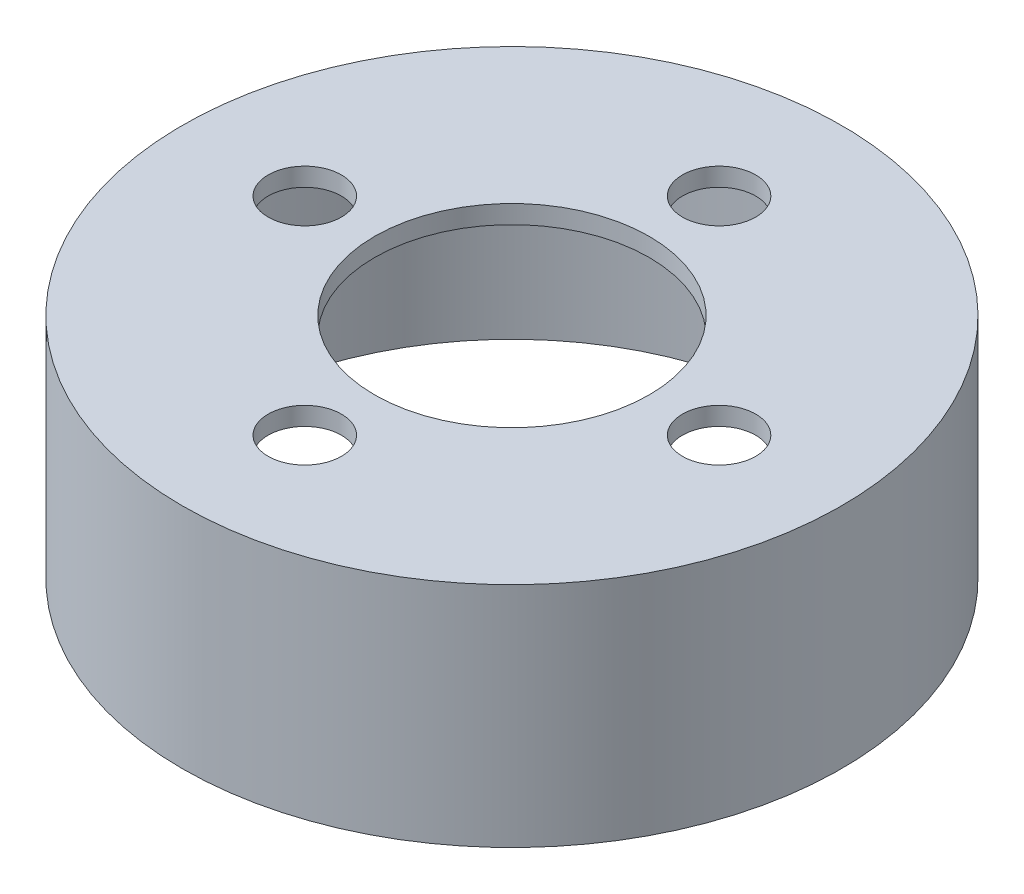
ISO-10303-21;
HEADER;
FILE_DESCRIPTION(('STEP AP214'),'2;1');
FILE_NAME('part.step','',(''),(''),'','','');
FILE_SCHEMA(('AUTOMOTIVE_DESIGN { 1 0 10303 214 1 1 1 1 }'));
ENDSEC;
DATA;
#1=APPLICATION_CONTEXT('core data for automotive mechanical design processes');
#2=APPLICATION_PROTOCOL_DEFINITION('international standard','automotive_design',2000,#1);
#3=PRODUCT_CONTEXT('',#1,'mechanical');
#4=PRODUCT('Part','Part','',(#3));
#5=PRODUCT_RELATED_PRODUCT_CATEGORY('part','',(#4));
#6=PRODUCT_DEFINITION_FORMATION('','',#4);
#7=PRODUCT_DEFINITION_CONTEXT('part definition',#1,'design');
#8=PRODUCT_DEFINITION('design','',#6,#7);
#9=PRODUCT_DEFINITION_SHAPE('','',#8);
#10=(LENGTH_UNIT() NAMED_UNIT(*) SI_UNIT(.MILLI.,.METRE.));
#11=(NAMED_UNIT(*) PLANE_ANGLE_UNIT() SI_UNIT($,.RADIAN.));
#12=(NAMED_UNIT(*) SI_UNIT($,.STERADIAN.) SOLID_ANGLE_UNIT());
#13=UNCERTAINTY_MEASURE_WITH_UNIT(LENGTH_MEASURE(1.E-05),#10,'distance_accuracy_value','');
#14=(GEOMETRIC_REPRESENTATION_CONTEXT(3) GLOBAL_UNCERTAINTY_ASSIGNED_CONTEXT((#13)) GLOBAL_UNIT_ASSIGNED_CONTEXT((#10,
#11,#12)) REPRESENTATION_CONTEXT('',''));
#15=CARTESIAN_POINT('',(0.,0.,0.));
#16=DIRECTION('',(0.,0.,1.));
#17=DIRECTION('',(1.,0.,0.));
#18=AXIS2_PLACEMENT_3D('',#15,#16,#17);
#19=CARTESIAN_POINT('',(0.,-12.433679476,0.));
#20=DIRECTION('',(0.,1.,0.));
#21=DIRECTION('',(0.,0.,1.));
#22=AXIS2_PLACEMENT_3D('',#19,#20,#21);
#23=CYLINDRICAL_SURFACE('',#22,16.);
#24=CARTESIAN_POINT('',(0.,-12.433679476,0.));
#25=DIRECTION('',(0.,1.,0.));
#26=DIRECTION('',(0.,0.,1.));
#27=AXIS2_PLACEMENT_3D('',#24,#25,#26);
#28=CIRCLE('',#27,16.);
#29=CARTESIAN_POINT('',(0.,-12.433679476,16.));
#30=VERTEX_POINT('',#29);
#31=EDGE_CURVE('E50',#30,#30,#28,.T.);
#32=ORIENTED_EDGE('',*,*,#31,.F.);
#33=EDGE_LOOP('',(#32));
#34=FACE_BOUND('',#33,.T.);
#35=CARTESIAN_POINT('',(0.,-1.,0.));
#36=DIRECTION('',(0.,1.,0.));
#37=DIRECTION('',(0.,0.,1.));
#38=AXIS2_PLACEMENT_3D('',#35,#36,#37);
#39=CIRCLE('',#38,16.);
#40=CARTESIAN_POINT('',(0.,-1.,16.));
#41=VERTEX_POINT('',#40);
#42=EDGE_CURVE('E10',#41,#41,#39,.F.);
#43=ORIENTED_EDGE('',*,*,#42,.F.);
#44=EDGE_LOOP('',(#43));
#45=FACE_BOUND('',#44,.T.);
#46=ADVANCED_FACE('F34',(#34,#45),#23,.F.);
#47=CARTESIAN_POINT('',(0.,-12.433679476,0.));
#48=DIRECTION('',(0.,1.,0.));
#49=DIRECTION('',(0.,0.,1.));
#50=AXIS2_PLACEMENT_3D('',#47,#48,#49);
#51=CYLINDRICAL_SURFACE('',#50,18.);
#52=CARTESIAN_POINT('',(0.,-12.433679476,0.));
#53=DIRECTION('',(0.,1.,0.));
#54=DIRECTION('',(0.,0.,1.));
#55=AXIS2_PLACEMENT_3D('',#52,#53,#54);
#56=CIRCLE('',#55,18.);
#57=CARTESIAN_POINT('',(0.,-12.433679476,18.));
#58=VERTEX_POINT('',#57);
#59=EDGE_CURVE('E41',#58,#58,#56,.T.);
#60=ORIENTED_EDGE('',*,*,#59,.T.);
#61=EDGE_LOOP('',(#60));
#62=FACE_BOUND('',#61,.T.);
#63=CARTESIAN_POINT('',(0.,0.,0.));
#64=DIRECTION('',(0.,1.,0.));
#65=DIRECTION('',(0.,0.,1.));
#66=AXIS2_PLACEMENT_3D('',#63,#64,#65);
#67=CIRCLE('',#66,18.);
#68=CARTESIAN_POINT('',(0.,0.,18.));
#69=VERTEX_POINT('',#68);
#70=EDGE_CURVE('E45',#69,#69,#67,.T.);
#71=ORIENTED_EDGE('',*,*,#70,.F.);
#72=EDGE_LOOP('',(#71));
#73=FACE_BOUND('',#72,.T.);
#74=ADVANCED_FACE('F36',(#62,#73),#51,.T.);
#75=CARTESIAN_POINT('',(0.,-12.433679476,0.));
#76=DIRECTION('',(0.,1.,0.));
#77=DIRECTION('',(0.,0.,1.));
#78=AXIS2_PLACEMENT_3D('',#75,#76,#77);
#79=PLANE('',#78);
#80=ORIENTED_EDGE('',*,*,#31,.T.);
#81=EDGE_LOOP('',(#80));
#82=FACE_BOUND('',#81,.T.);
#83=ORIENTED_EDGE('',*,*,#59,.F.);
#84=EDGE_LOOP('',(#83));
#85=FACE_BOUND('',#84,.T.);
#86=ADVANCED_FACE('F92',(#82,#85),#79,.F.);
#87=CARTESIAN_POINT('',(0.,0.,0.));
#88=DIRECTION('',(0.,1.,0.));
#89=DIRECTION('',(0.,0.,1.));
#90=AXIS2_PLACEMENT_3D('',#87,#88,#89);
#91=PLANE('',#90);
#92=CARTESIAN_POINT('',(11.3137085,0.,0.));
#93=DIRECTION('',(0.,1.,0.));
#94=DIRECTION('',(1.,0.,0.));
#95=AXIS2_PLACEMENT_3D('',#92,#93,#94);
#96=CIRCLE('',#95,2.);
#97=CARTESIAN_POINT('',(11.3137085,0.,1.99999999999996));
#98=VERTEX_POINT('',#97);
#99=EDGE_CURVE('E77',#98,#98,#96,.T.);
#100=ORIENTED_EDGE('',*,*,#99,.F.);
#101=EDGE_LOOP('',(#100));
#102=FACE_BOUND('',#101,.T.);
#103=CARTESIAN_POINT('',(0.,0.,-11.3137085));
#104=DIRECTION('',(0.,1.,0.));
#105=DIRECTION('',(0.,0.,-1.));
#106=AXIS2_PLACEMENT_3D('',#103,#104,#105);
#107=CIRCLE('',#106,2.);
#108=CARTESIAN_POINT('',(0.,0.,-9.3137085));
#109=VERTEX_POINT('',#108);
#110=EDGE_CURVE('E70',#109,#109,#107,.T.);
#111=ORIENTED_EDGE('',*,*,#110,.F.);
#112=EDGE_LOOP('',(#111));
#113=FACE_BOUND('',#112,.T.);
#114=CARTESIAN_POINT('',(-11.3137085,0.,1.18504806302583E-13));
#115=DIRECTION('',(0.,1.,0.));
#116=DIRECTION('',(-1.,0.,0.));
#117=AXIS2_PLACEMENT_3D('',#114,#115,#116);
#118=CIRCLE('',#117,2.);
#119=CARTESIAN_POINT('',(-11.3137085,0.,2.00000000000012));
#120=VERTEX_POINT('',#119);
#121=EDGE_CURVE('E71',#120,#120,#118,.T.);
#122=ORIENTED_EDGE('',*,*,#121,.F.);
#123=EDGE_LOOP('',(#122));
#124=FACE_BOUND('',#123,.T.);
#125=CARTESIAN_POINT('',(0.,0.,11.3137085));
#126=DIRECTION('',(0.,1.,0.));
#127=DIRECTION('',(0.,0.,1.));
#128=AXIS2_PLACEMENT_3D('',#125,#126,#127);
#129=CIRCLE('',#128,2.);
#130=CARTESIAN_POINT('',(0.,0.,13.3137085));
#131=VERTEX_POINT('',#130);
#132=EDGE_CURVE('E63',#131,#131,#129,.T.);
#133=ORIENTED_EDGE('',*,*,#132,.F.);
#134=EDGE_LOOP('',(#133));
#135=FACE_BOUND('',#134,.T.);
#136=ORIENTED_EDGE('',*,*,#70,.T.);
#137=EDGE_LOOP('',(#136));
#138=FACE_BOUND('',#137,.T.);
#139=CARTESIAN_POINT('',(0.,0.,0.));
#140=DIRECTION('',(0.,1.,0.));
#141=DIRECTION('',(0.,0.,1.));
#142=AXIS2_PLACEMENT_3D('',#139,#140,#141);
#143=CIRCLE('',#142,7.50000000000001);
#144=CARTESIAN_POINT('',(0.,0.,7.50000000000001));
#145=VERTEX_POINT('',#144);
#146=EDGE_CURVE('E55',#145,#145,#143,.T.);
#147=ORIENTED_EDGE('',*,*,#146,.F.);
#148=EDGE_LOOP('',(#147));
#149=FACE_BOUND('',#148,.T.);
#150=ADVANCED_FACE('F88',(#102,#113,#124,#135,#138,#149),#91,.T.);
#151=CARTESIAN_POINT('',(0.,-1.,0.));
#152=DIRECTION('',(0.,1.,0.));
#153=DIRECTION('',(0.,0.,1.));
#154=AXIS2_PLACEMENT_3D('',#151,#152,#153);
#155=PLANE('',#154);
#156=CARTESIAN_POINT('',(11.3137085,-0.999999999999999,0.));
#157=DIRECTION('',(0.,1.,0.));
#158=DIRECTION('',(0.,0.,1.));
#159=AXIS2_PLACEMENT_3D('',#156,#157,#158);
#160=CIRCLE('',#159,2.);
#161=CARTESIAN_POINT('',(11.3137085,-1.,1.99999999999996));
#162=VERTEX_POINT('',#161);
#163=EDGE_CURVE('E66',#162,#162,#160,.F.);
#164=ORIENTED_EDGE('',*,*,#163,.F.);
#165=EDGE_LOOP('',(#164));
#166=FACE_BOUND('',#165,.T.);
#167=CARTESIAN_POINT('',(0.,-0.999999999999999,-11.3137085));
#168=DIRECTION('',(0.,1.,0.));
#169=DIRECTION('',(0.,0.,1.));
#170=AXIS2_PLACEMENT_3D('',#167,#168,#169);
#171=CIRCLE('',#170,2.);
#172=CARTESIAN_POINT('',(0.,-1.,-9.3137085));
#173=VERTEX_POINT('',#172);
#174=EDGE_CURVE('E74',#173,#173,#171,.F.);
#175=ORIENTED_EDGE('',*,*,#174,.F.);
#176=EDGE_LOOP('',(#175));
#177=FACE_BOUND('',#176,.T.);
#178=CARTESIAN_POINT('',(-11.3137085,-0.999999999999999,1.18504806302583E-13));
#179=DIRECTION('',(0.,1.,0.));
#180=DIRECTION('',(0.,0.,1.));
#181=AXIS2_PLACEMENT_3D('',#178,#179,#180);
#182=CIRCLE('',#181,2.);
#183=CARTESIAN_POINT('',(-11.3137085,-1.,2.00000000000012));
#184=VERTEX_POINT('',#183);
#185=EDGE_CURVE('E67',#184,#184,#182,.F.);
#186=ORIENTED_EDGE('',*,*,#185,.F.);
#187=EDGE_LOOP('',(#186));
#188=FACE_BOUND('',#187,.T.);
#189=CARTESIAN_POINT('',(0.,-0.999999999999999,11.3137085));
#190=DIRECTION('',(0.,1.,0.));
#191=DIRECTION('',(0.,0.,1.));
#192=AXIS2_PLACEMENT_3D('',#189,#190,#191);
#193=CIRCLE('',#192,2.);
#194=CARTESIAN_POINT('',(0.,-1.,13.3137085));
#195=VERTEX_POINT('',#194);
#196=EDGE_CURVE('E58',#195,#195,#193,.F.);
#197=ORIENTED_EDGE('',*,*,#196,.F.);
#198=EDGE_LOOP('',(#197));
#199=FACE_BOUND('',#198,.T.);
#200=CARTESIAN_POINT('',(0.,-1.,0.));
#201=DIRECTION('',(0.,1.,0.));
#202=DIRECTION('',(0.,0.,1.));
#203=AXIS2_PLACEMENT_3D('',#200,#201,#202);
#204=CIRCLE('',#203,7.50000000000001);
#205=CARTESIAN_POINT('',(0.,-1.,7.50000000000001));
#206=VERTEX_POINT('',#205);
#207=EDGE_CURVE('E54',#206,#206,#204,.T.);
#208=ORIENTED_EDGE('',*,*,#207,.T.);
#209=EDGE_LOOP('',(#208));
#210=FACE_BOUND('',#209,.T.);
#211=ORIENTED_EDGE('',*,*,#42,.T.);
#212=EDGE_LOOP('',(#211));
#213=FACE_BOUND('',#212,.T.);
#214=ADVANCED_FACE('F91',(#166,#177,#188,#199,#210,#213),#155,.F.);
#215=CARTESIAN_POINT('',(0.,-1.,0.));
#216=DIRECTION('',(0.,1.,0.));
#217=DIRECTION('',(0.,0.,1.));
#218=AXIS2_PLACEMENT_3D('',#215,#216,#217);
#219=CYLINDRICAL_SURFACE('',#218,7.50000000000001);
#220=ORIENTED_EDGE('',*,*,#207,.F.);
#221=EDGE_LOOP('',(#220));
#222=FACE_BOUND('',#221,.T.);
#223=ORIENTED_EDGE('',*,*,#146,.T.);
#224=EDGE_LOOP('',(#223));
#225=FACE_BOUND('',#224,.T.);
#226=ADVANCED_FACE('F103',(#222,#225),#219,.F.);
#227=CARTESIAN_POINT('',(0.,-12.434679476,11.3137085));
#228=DIRECTION('',(0.,1.,0.));
#229=DIRECTION('',(0.,0.,1.));
#230=AXIS2_PLACEMENT_3D('',#227,#228,#229);
#231=CYLINDRICAL_SURFACE('',#230,2.);
#232=CARTESIAN_POINT('',(0.,0.,13.3137085));
#233=CARTESIAN_POINT('',(0.,-0.0104166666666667,13.3137085));
#234=CARTESIAN_POINT('',(0.,-0.0208333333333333,13.3137085));
#235=CARTESIAN_POINT('',(0.,-0.0416666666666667,13.3137085));
#236=CARTESIAN_POINT('',(0.,-0.0520833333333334,13.3137085));
#237=CARTESIAN_POINT('',(0.,-0.0729166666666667,13.3137085));
#238=CARTESIAN_POINT('',(0.,-0.0833333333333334,13.3137085));
#239=CARTESIAN_POINT('',(0.,-0.104166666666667,13.3137085));
#240=CARTESIAN_POINT('',(0.,-0.114583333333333,13.3137085));
#241=CARTESIAN_POINT('',(0.,-0.135416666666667,13.3137085));
#242=CARTESIAN_POINT('',(0.,-0.145833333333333,13.3137085));
#243=CARTESIAN_POINT('',(0.,-0.166666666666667,13.3137085));
#244=CARTESIAN_POINT('',(0.,-0.177083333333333,13.3137085));
#245=CARTESIAN_POINT('',(0.,-0.197916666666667,13.3137085));
#246=CARTESIAN_POINT('',(0.,-0.208333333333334,13.3137085));
#247=CARTESIAN_POINT('',(0.,-0.229166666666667,13.3137085));
#248=CARTESIAN_POINT('',(0.,-0.239583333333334,13.3137085));
#249=CARTESIAN_POINT('',(0.,-0.260416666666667,13.3137085));
#250=CARTESIAN_POINT('',(0.,-0.270833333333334,13.3137085));
#251=CARTESIAN_POINT('',(0.,-0.291666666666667,13.3137085));
#252=CARTESIAN_POINT('',(0.,-0.302083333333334,13.3137085));
#253=CARTESIAN_POINT('',(0.,-0.322916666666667,13.3137085));
#254=CARTESIAN_POINT('',(0.,-0.333333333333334,13.3137085));
#255=CARTESIAN_POINT('',(0.,-0.354166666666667,13.3137085));
#256=CARTESIAN_POINT('',(0.,-0.364583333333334,13.3137085));
#257=CARTESIAN_POINT('',(0.,-0.385416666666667,13.3137085));
#258=CARTESIAN_POINT('',(0.,-0.395833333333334,13.3137085));
#259=CARTESIAN_POINT('',(0.,-0.416666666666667,13.3137085));
#260=CARTESIAN_POINT('',(0.,-0.427083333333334,13.3137085));
#261=CARTESIAN_POINT('',(0.,-0.447916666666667,13.3137085));
#262=CARTESIAN_POINT('',(0.,-0.458333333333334,13.3137085));
#263=CARTESIAN_POINT('',(0.,-0.479166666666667,13.3137085));
#264=CARTESIAN_POINT('',(0.,-0.489583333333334,13.3137085));
#265=CARTESIAN_POINT('',(0.,-0.510416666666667,13.3137085));
#266=CARTESIAN_POINT('',(0.,-0.520833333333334,13.3137085));
#267=CARTESIAN_POINT('',(0.,-0.541666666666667,13.3137085));
#268=CARTESIAN_POINT('',(0.,-0.552083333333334,13.3137085));
#269=CARTESIAN_POINT('',(0.,-0.572916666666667,13.3137085));
#270=CARTESIAN_POINT('',(0.,-0.583333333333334,13.3137085));
#271=CARTESIAN_POINT('',(0.,-0.604166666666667,13.3137085));
#272=CARTESIAN_POINT('',(0.,-0.614583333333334,13.3137085));
#273=CARTESIAN_POINT('',(0.,-0.635416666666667,13.3137085));
#274=CARTESIAN_POINT('',(0.,-0.645833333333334,13.3137085));
#275=CARTESIAN_POINT('',(0.,-0.666666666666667,13.3137085));
#276=CARTESIAN_POINT('',(0.,-0.677083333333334,13.3137085));
#277=CARTESIAN_POINT('',(0.,-0.697916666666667,13.3137085));
#278=CARTESIAN_POINT('',(0.,-0.708333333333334,13.3137085));
#279=CARTESIAN_POINT('',(0.,-0.729166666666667,13.3137085));
#280=CARTESIAN_POINT('',(0.,-0.739583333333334,13.3137085));
#281=CARTESIAN_POINT('',(0.,-0.760416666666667,13.3137085));
#282=CARTESIAN_POINT('',(0.,-0.770833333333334,13.3137085));
#283=CARTESIAN_POINT('',(0.,-0.791666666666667,13.3137085));
#284=CARTESIAN_POINT('',(0.,-0.802083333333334,13.3137085));
#285=CARTESIAN_POINT('',(0.,-0.822916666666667,13.3137085));
#286=CARTESIAN_POINT('',(0.,-0.833333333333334,13.3137085));
#287=CARTESIAN_POINT('',(0.,-0.854166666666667,13.3137085));
#288=CARTESIAN_POINT('',(0.,-0.864583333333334,13.3137085));
#289=CARTESIAN_POINT('',(0.,-0.885416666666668,13.3137085));
#290=CARTESIAN_POINT('',(0.,-0.895833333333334,13.3137085));
#291=CARTESIAN_POINT('',(0.,-0.916666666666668,13.3137085));
#292=CARTESIAN_POINT('',(0.,-0.927083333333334,13.3137085));
#293=CARTESIAN_POINT('',(0.,-0.947916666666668,13.3137085));
#294=CARTESIAN_POINT('',(0.,-0.958333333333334,13.3137085));
#295=CARTESIAN_POINT('',(0.,-0.979166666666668,13.3137085));
#296=CARTESIAN_POINT('',(0.,-0.989583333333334,13.3137085));
#297=CARTESIAN_POINT('',(0.,-1.,13.3137085));
#298=B_SPLINE_CURVE_WITH_KNOTS('',3,(#232,#233,#234,#235,#236,#237,#238,#239,#240,#241,#242,
#243,#244,#245,#246,#247,#248,#249,#250,#251,#252,#253,#254,#255,#256,#257,#258,#259,#260,#261,
#262,#263,#264,#265,#266,#267,#268,#269,#270,#271,#272,#273,#274,#275,#276,#277,#278,#279,#280,
#281,#282,#283,#284,#285,#286,#287,#288,#289,#290,#291,#292,#293,#294,#295,#296,#297),
.UNSPECIFIED.,.F.,.F.,(4,2,2,2,2,2,2,2,2,2,2,2,2,2,2,2,2,2,2,2,2,2,2,2,2,2,2,2,2,2,2,2,4),(0.,
0.03125,0.0625000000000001,0.0937500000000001,0.125,0.15625,0.1875,0.21875,0.25,0.28125,0.3125,
0.34375,0.375,0.40625,0.4375,0.46875,0.5,0.53125,0.5625,0.593750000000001,0.625000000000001,
0.656250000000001,0.687500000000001,0.718750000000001,0.750000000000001,0.781250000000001,
0.812500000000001,0.843750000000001,0.875000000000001,0.906250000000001,0.937500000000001,
0.968750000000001,1.),.UNSPECIFIED.);
#299=EDGE_CURVE('BSEAM105',#131,#195,#298,.T.);
#300=ORIENTED_EDGE('',*,*,#132,.T.);
#301=ORIENTED_EDGE('',*,*,#196,.T.);
#302=ORIENTED_EDGE('',*,*,#299,.T.);
#303=ORIENTED_EDGE('',*,*,#299,.F.);
#304=EDGE_LOOP('',(#300,#302,#301,#303));
#305=FACE_BOUND('',#304,.T.);
#306=ADVANCED_FACE('F105',(#305),#231,.F.);
#307=CARTESIAN_POINT('',(-11.3137085,-12.434679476,1.18504806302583E-13));
#308=DIRECTION('',(0.,1.,0.));
#309=DIRECTION('',(0.,0.,1.));
#310=AXIS2_PLACEMENT_3D('',#307,#308,#309);
#311=CYLINDRICAL_SURFACE('',#310,2.);
#312=CARTESIAN_POINT('',(-11.3137085,0.,2.00000000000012));
#313=CARTESIAN_POINT('',(-11.3137085,-0.0104166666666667,2.00000000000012));
#314=CARTESIAN_POINT('',(-11.3137085,-0.0208333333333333,2.00000000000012));
#315=CARTESIAN_POINT('',(-11.3137085,-0.0416666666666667,2.00000000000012));
#316=CARTESIAN_POINT('',(-11.3137085,-0.0520833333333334,2.00000000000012));
#317=CARTESIAN_POINT('',(-11.3137085,-0.0729166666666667,2.00000000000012));
#318=CARTESIAN_POINT('',(-11.3137085,-0.0833333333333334,2.00000000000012));
#319=CARTESIAN_POINT('',(-11.3137085,-0.104166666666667,2.00000000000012));
#320=CARTESIAN_POINT('',(-11.3137085,-0.114583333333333,2.00000000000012));
#321=CARTESIAN_POINT('',(-11.3137085,-0.135416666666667,2.00000000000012));
#322=CARTESIAN_POINT('',(-11.3137085,-0.145833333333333,2.00000000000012));
#323=CARTESIAN_POINT('',(-11.3137085,-0.166666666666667,2.00000000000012));
#324=CARTESIAN_POINT('',(-11.3137085,-0.177083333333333,2.00000000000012));
#325=CARTESIAN_POINT('',(-11.3137085,-0.197916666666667,2.00000000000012));
#326=CARTESIAN_POINT('',(-11.3137085,-0.208333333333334,2.00000000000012));
#327=CARTESIAN_POINT('',(-11.3137085,-0.229166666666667,2.00000000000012));
#328=CARTESIAN_POINT('',(-11.3137085,-0.239583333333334,2.00000000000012));
#329=CARTESIAN_POINT('',(-11.3137085,-0.260416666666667,2.00000000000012));
#330=CARTESIAN_POINT('',(-11.3137085,-0.270833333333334,2.00000000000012));
#331=CARTESIAN_POINT('',(-11.3137085,-0.291666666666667,2.00000000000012));
#332=CARTESIAN_POINT('',(-11.3137085,-0.302083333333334,2.00000000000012));
#333=CARTESIAN_POINT('',(-11.3137085,-0.322916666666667,2.00000000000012));
#334=CARTESIAN_POINT('',(-11.3137085,-0.333333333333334,2.00000000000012));
#335=CARTESIAN_POINT('',(-11.3137085,-0.354166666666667,2.00000000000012));
#336=CARTESIAN_POINT('',(-11.3137085,-0.364583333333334,2.00000000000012));
#337=CARTESIAN_POINT('',(-11.3137085,-0.385416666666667,2.00000000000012));
#338=CARTESIAN_POINT('',(-11.3137085,-0.395833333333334,2.00000000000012));
#339=CARTESIAN_POINT('',(-11.3137085,-0.416666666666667,2.00000000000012));
#340=CARTESIAN_POINT('',(-11.3137085,-0.427083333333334,2.00000000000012));
#341=CARTESIAN_POINT('',(-11.3137085,-0.447916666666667,2.00000000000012));
#342=CARTESIAN_POINT('',(-11.3137085,-0.458333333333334,2.00000000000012));
#343=CARTESIAN_POINT('',(-11.3137085,-0.479166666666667,2.00000000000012));
#344=CARTESIAN_POINT('',(-11.3137085,-0.489583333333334,2.00000000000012));
#345=CARTESIAN_POINT('',(-11.3137085,-0.510416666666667,2.00000000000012));
#346=CARTESIAN_POINT('',(-11.3137085,-0.520833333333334,2.00000000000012));
#347=CARTESIAN_POINT('',(-11.3137085,-0.541666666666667,2.00000000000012));
#348=CARTESIAN_POINT('',(-11.3137085,-0.552083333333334,2.00000000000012));
#349=CARTESIAN_POINT('',(-11.3137085,-0.572916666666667,2.00000000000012));
#350=CARTESIAN_POINT('',(-11.3137085,-0.583333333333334,2.00000000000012));
#351=CARTESIAN_POINT('',(-11.3137085,-0.604166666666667,2.00000000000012));
#352=CARTESIAN_POINT('',(-11.3137085,-0.614583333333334,2.00000000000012));
#353=CARTESIAN_POINT('',(-11.3137085,-0.635416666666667,2.00000000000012));
#354=CARTESIAN_POINT('',(-11.3137085,-0.645833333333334,2.00000000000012));
#355=CARTESIAN_POINT('',(-11.3137085,-0.666666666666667,2.00000000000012));
#356=CARTESIAN_POINT('',(-11.3137085,-0.677083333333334,2.00000000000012));
#357=CARTESIAN_POINT('',(-11.3137085,-0.697916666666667,2.00000000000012));
#358=CARTESIAN_POINT('',(-11.3137085,-0.708333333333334,2.00000000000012));
#359=CARTESIAN_POINT('',(-11.3137085,-0.729166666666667,2.00000000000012));
#360=CARTESIAN_POINT('',(-11.3137085,-0.739583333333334,2.00000000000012));
#361=CARTESIAN_POINT('',(-11.3137085,-0.760416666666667,2.00000000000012));
#362=CARTESIAN_POINT('',(-11.3137085,-0.770833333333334,2.00000000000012));
#363=CARTESIAN_POINT('',(-11.3137085,-0.791666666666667,2.00000000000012));
#364=CARTESIAN_POINT('',(-11.3137085,-0.802083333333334,2.00000000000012));
#365=CARTESIAN_POINT('',(-11.3137085,-0.822916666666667,2.00000000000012));
#366=CARTESIAN_POINT('',(-11.3137085,-0.833333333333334,2.00000000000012));
#367=CARTESIAN_POINT('',(-11.3137085,-0.854166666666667,2.00000000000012));
#368=CARTESIAN_POINT('',(-11.3137085,-0.864583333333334,2.00000000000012));
#369=CARTESIAN_POINT('',(-11.3137085,-0.885416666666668,2.00000000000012));
#370=CARTESIAN_POINT('',(-11.3137085,-0.895833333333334,2.00000000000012));
#371=CARTESIAN_POINT('',(-11.3137085,-0.916666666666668,2.00000000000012));
#372=CARTESIAN_POINT('',(-11.3137085,-0.927083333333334,2.00000000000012));
#373=CARTESIAN_POINT('',(-11.3137085,-0.947916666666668,2.00000000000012));
#374=CARTESIAN_POINT('',(-11.3137085,-0.958333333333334,2.00000000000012));
#375=CARTESIAN_POINT('',(-11.3137085,-0.979166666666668,2.00000000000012));
#376=CARTESIAN_POINT('',(-11.3137085,-0.989583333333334,2.00000000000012));
#377=CARTESIAN_POINT('',(-11.3137085,-1.,2.00000000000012));
#378=B_SPLINE_CURVE_WITH_KNOTS('',3,(#312,#313,#314,#315,#316,#317,#318,#319,#320,#321,#322,
#323,#324,#325,#326,#327,#328,#329,#330,#331,#332,#333,#334,#335,#336,#337,#338,#339,#340,#341,
#342,#343,#344,#345,#346,#347,#348,#349,#350,#351,#352,#353,#354,#355,#356,#357,#358,#359,#360,
#361,#362,#363,#364,#365,#366,#367,#368,#369,#370,#371,#372,#373,#374,#375,#376,#377),
.UNSPECIFIED.,.F.,.F.,(4,2,2,2,2,2,2,2,2,2,2,2,2,2,2,2,2,2,2,2,2,2,2,2,2,2,2,2,2,2,2,2,4),(0.,
0.03125,0.0625000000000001,0.0937500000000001,0.125,0.15625,0.1875,0.21875,0.25,0.28125,0.3125,
0.34375,0.375,0.40625,0.4375,0.46875,0.5,0.53125,0.5625,0.593750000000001,0.625000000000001,
0.656250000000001,0.687500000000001,0.718750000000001,0.750000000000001,0.781250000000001,
0.812500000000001,0.843750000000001,0.875000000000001,0.906250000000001,0.937500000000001,
0.968750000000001,1.),.UNSPECIFIED.);
#379=EDGE_CURVE('BSEAM112',#120,#184,#378,.T.);
#380=ORIENTED_EDGE('',*,*,#121,.T.);
#381=ORIENTED_EDGE('',*,*,#185,.T.);
#382=ORIENTED_EDGE('',*,*,#379,.T.);
#383=ORIENTED_EDGE('',*,*,#379,.F.);
#384=EDGE_LOOP('',(#380,#382,#381,#383));
#385=FACE_BOUND('',#384,.T.);
#386=ADVANCED_FACE('F112',(#385),#311,.F.);
#387=CARTESIAN_POINT('',(0.,-12.434679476,-11.3137085));
#388=DIRECTION('',(0.,1.,0.));
#389=DIRECTION('',(0.,0.,1.));
#390=AXIS2_PLACEMENT_3D('',#387,#388,#389);
#391=CYLINDRICAL_SURFACE('',#390,2.);
#392=CARTESIAN_POINT('',(0.,0.,-9.3137085));
#393=CARTESIAN_POINT('',(0.,-0.0104166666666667,-9.3137085));
#394=CARTESIAN_POINT('',(0.,-0.0208333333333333,-9.3137085));
#395=CARTESIAN_POINT('',(0.,-0.0416666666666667,-9.3137085));
#396=CARTESIAN_POINT('',(0.,-0.0520833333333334,-9.3137085));
#397=CARTESIAN_POINT('',(0.,-0.0729166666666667,-9.3137085));
#398=CARTESIAN_POINT('',(0.,-0.0833333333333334,-9.3137085));
#399=CARTESIAN_POINT('',(0.,-0.104166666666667,-9.3137085));
#400=CARTESIAN_POINT('',(0.,-0.114583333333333,-9.3137085));
#401=CARTESIAN_POINT('',(0.,-0.135416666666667,-9.3137085));
#402=CARTESIAN_POINT('',(0.,-0.145833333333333,-9.3137085));
#403=CARTESIAN_POINT('',(0.,-0.166666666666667,-9.3137085));
#404=CARTESIAN_POINT('',(0.,-0.177083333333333,-9.3137085));
#405=CARTESIAN_POINT('',(0.,-0.197916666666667,-9.3137085));
#406=CARTESIAN_POINT('',(0.,-0.208333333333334,-9.3137085));
#407=CARTESIAN_POINT('',(0.,-0.229166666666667,-9.3137085));
#408=CARTESIAN_POINT('',(0.,-0.239583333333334,-9.3137085));
#409=CARTESIAN_POINT('',(0.,-0.260416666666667,-9.3137085));
#410=CARTESIAN_POINT('',(0.,-0.270833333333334,-9.3137085));
#411=CARTESIAN_POINT('',(0.,-0.291666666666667,-9.3137085));
#412=CARTESIAN_POINT('',(0.,-0.302083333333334,-9.3137085));
#413=CARTESIAN_POINT('',(0.,-0.322916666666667,-9.3137085));
#414=CARTESIAN_POINT('',(0.,-0.333333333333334,-9.3137085));
#415=CARTESIAN_POINT('',(0.,-0.354166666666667,-9.3137085));
#416=CARTESIAN_POINT('',(0.,-0.364583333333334,-9.3137085));
#417=CARTESIAN_POINT('',(0.,-0.385416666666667,-9.3137085));
#418=CARTESIAN_POINT('',(0.,-0.395833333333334,-9.3137085));
#419=CARTESIAN_POINT('',(0.,-0.416666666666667,-9.3137085));
#420=CARTESIAN_POINT('',(0.,-0.427083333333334,-9.3137085));
#421=CARTESIAN_POINT('',(0.,-0.447916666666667,-9.3137085));
#422=CARTESIAN_POINT('',(0.,-0.458333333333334,-9.3137085));
#423=CARTESIAN_POINT('',(0.,-0.479166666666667,-9.3137085));
#424=CARTESIAN_POINT('',(0.,-0.489583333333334,-9.3137085));
#425=CARTESIAN_POINT('',(0.,-0.510416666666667,-9.3137085));
#426=CARTESIAN_POINT('',(0.,-0.520833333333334,-9.3137085));
#427=CARTESIAN_POINT('',(0.,-0.541666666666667,-9.3137085));
#428=CARTESIAN_POINT('',(0.,-0.552083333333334,-9.3137085));
#429=CARTESIAN_POINT('',(0.,-0.572916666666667,-9.3137085));
#430=CARTESIAN_POINT('',(0.,-0.583333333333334,-9.3137085));
#431=CARTESIAN_POINT('',(0.,-0.604166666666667,-9.3137085));
#432=CARTESIAN_POINT('',(0.,-0.614583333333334,-9.3137085));
#433=CARTESIAN_POINT('',(0.,-0.635416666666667,-9.3137085));
#434=CARTESIAN_POINT('',(0.,-0.645833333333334,-9.3137085));
#435=CARTESIAN_POINT('',(0.,-0.666666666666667,-9.3137085));
#436=CARTESIAN_POINT('',(0.,-0.677083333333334,-9.3137085));
#437=CARTESIAN_POINT('',(0.,-0.697916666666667,-9.3137085));
#438=CARTESIAN_POINT('',(0.,-0.708333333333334,-9.3137085));
#439=CARTESIAN_POINT('',(0.,-0.729166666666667,-9.3137085));
#440=CARTESIAN_POINT('',(0.,-0.739583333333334,-9.3137085));
#441=CARTESIAN_POINT('',(0.,-0.760416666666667,-9.3137085));
#442=CARTESIAN_POINT('',(0.,-0.770833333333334,-9.3137085));
#443=CARTESIAN_POINT('',(0.,-0.791666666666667,-9.3137085));
#444=CARTESIAN_POINT('',(0.,-0.802083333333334,-9.3137085));
#445=CARTESIAN_POINT('',(0.,-0.822916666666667,-9.3137085));
#446=CARTESIAN_POINT('',(0.,-0.833333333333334,-9.3137085));
#447=CARTESIAN_POINT('',(0.,-0.854166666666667,-9.3137085));
#448=CARTESIAN_POINT('',(0.,-0.864583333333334,-9.3137085));
#449=CARTESIAN_POINT('',(0.,-0.885416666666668,-9.3137085));
#450=CARTESIAN_POINT('',(0.,-0.895833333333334,-9.3137085));
#451=CARTESIAN_POINT('',(0.,-0.916666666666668,-9.3137085));
#452=CARTESIAN_POINT('',(0.,-0.927083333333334,-9.3137085));
#453=CARTESIAN_POINT('',(0.,-0.947916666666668,-9.3137085));
#454=CARTESIAN_POINT('',(0.,-0.958333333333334,-9.3137085));
#455=CARTESIAN_POINT('',(0.,-0.979166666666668,-9.3137085));
#456=CARTESIAN_POINT('',(0.,-0.989583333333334,-9.3137085));
#457=CARTESIAN_POINT('',(0.,-1.,-9.3137085));
#458=B_SPLINE_CURVE_WITH_KNOTS('',3,(#392,#393,#394,#395,#396,#397,#398,#399,#400,#401,#402,
#403,#404,#405,#406,#407,#408,#409,#410,#411,#412,#413,#414,#415,#416,#417,#418,#419,#420,#421,
#422,#423,#424,#425,#426,#427,#428,#429,#430,#431,#432,#433,#434,#435,#436,#437,#438,#439,#440,
#441,#442,#443,#444,#445,#446,#447,#448,#449,#450,#451,#452,#453,#454,#455,#456,#457),
.UNSPECIFIED.,.F.,.F.,(4,2,2,2,2,2,2,2,2,2,2,2,2,2,2,2,2,2,2,2,2,2,2,2,2,2,2,2,2,2,2,2,4),(0.,
0.03125,0.0625000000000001,0.0937500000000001,0.125,0.15625,0.1875,0.21875,0.25,0.28125,0.3125,
0.34375,0.375,0.40625,0.4375,0.46875,0.5,0.53125,0.5625,0.593750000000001,0.625000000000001,
0.656250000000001,0.687500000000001,0.718750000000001,0.750000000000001,0.781250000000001,
0.812500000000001,0.843750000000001,0.875000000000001,0.906250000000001,0.937500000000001,
0.968750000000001,1.),.UNSPECIFIED.);
#459=EDGE_CURVE('BSEAM153',#109,#173,#458,.T.);
#460=ORIENTED_EDGE('',*,*,#110,.T.);
#461=ORIENTED_EDGE('',*,*,#174,.T.);
#462=ORIENTED_EDGE('',*,*,#459,.T.);
#463=ORIENTED_EDGE('',*,*,#459,.F.);
#464=EDGE_LOOP('',(#460,#462,#461,#463));
#465=FACE_BOUND('',#464,.T.);
#466=ADVANCED_FACE('F153',(#465),#391,.F.);
#467=CARTESIAN_POINT('',(11.3137085,-12.434679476,0.));
#468=DIRECTION('',(0.,1.,0.));
#469=DIRECTION('',(0.,0.,1.));
#470=AXIS2_PLACEMENT_3D('',#467,#468,#469);
#471=CYLINDRICAL_SURFACE('',#470,2.);
#472=CARTESIAN_POINT('',(11.3137085,0.,1.99999999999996));
#473=CARTESIAN_POINT('',(11.3137085,-0.0104166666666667,1.99999999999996));
#474=CARTESIAN_POINT('',(11.3137085,-0.0208333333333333,1.99999999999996));
#475=CARTESIAN_POINT('',(11.3137085,-0.0416666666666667,1.99999999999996));
#476=CARTESIAN_POINT('',(11.3137085,-0.0520833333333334,1.99999999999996));
#477=CARTESIAN_POINT('',(11.3137085,-0.0729166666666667,1.99999999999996));
#478=CARTESIAN_POINT('',(11.3137085,-0.0833333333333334,1.99999999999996));
#479=CARTESIAN_POINT('',(11.3137085,-0.104166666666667,1.99999999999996));
#480=CARTESIAN_POINT('',(11.3137085,-0.114583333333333,1.99999999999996));
#481=CARTESIAN_POINT('',(11.3137085,-0.135416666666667,1.99999999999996));
#482=CARTESIAN_POINT('',(11.3137085,-0.145833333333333,1.99999999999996));
#483=CARTESIAN_POINT('',(11.3137085,-0.166666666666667,1.99999999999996));
#484=CARTESIAN_POINT('',(11.3137085,-0.177083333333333,1.99999999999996));
#485=CARTESIAN_POINT('',(11.3137085,-0.197916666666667,1.99999999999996));
#486=CARTESIAN_POINT('',(11.3137085,-0.208333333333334,1.99999999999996));
#487=CARTESIAN_POINT('',(11.3137085,-0.229166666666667,1.99999999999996));
#488=CARTESIAN_POINT('',(11.3137085,-0.239583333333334,1.99999999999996));
#489=CARTESIAN_POINT('',(11.3137085,-0.260416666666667,1.99999999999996));
#490=CARTESIAN_POINT('',(11.3137085,-0.270833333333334,1.99999999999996));
#491=CARTESIAN_POINT('',(11.3137085,-0.291666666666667,1.99999999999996));
#492=CARTESIAN_POINT('',(11.3137085,-0.302083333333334,1.99999999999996));
#493=CARTESIAN_POINT('',(11.3137085,-0.322916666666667,1.99999999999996));
#494=CARTESIAN_POINT('',(11.3137085,-0.333333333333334,1.99999999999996));
#495=CARTESIAN_POINT('',(11.3137085,-0.354166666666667,1.99999999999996));
#496=CARTESIAN_POINT('',(11.3137085,-0.364583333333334,1.99999999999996));
#497=CARTESIAN_POINT('',(11.3137085,-0.385416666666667,1.99999999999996));
#498=CARTESIAN_POINT('',(11.3137085,-0.395833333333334,1.99999999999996));
#499=CARTESIAN_POINT('',(11.3137085,-0.416666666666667,1.99999999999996));
#500=CARTESIAN_POINT('',(11.3137085,-0.427083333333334,1.99999999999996));
#501=CARTESIAN_POINT('',(11.3137085,-0.447916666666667,1.99999999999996));
#502=CARTESIAN_POINT('',(11.3137085,-0.458333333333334,1.99999999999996));
#503=CARTESIAN_POINT('',(11.3137085,-0.479166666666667,1.99999999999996));
#504=CARTESIAN_POINT('',(11.3137085,-0.489583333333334,1.99999999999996));
#505=CARTESIAN_POINT('',(11.3137085,-0.510416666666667,1.99999999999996));
#506=CARTESIAN_POINT('',(11.3137085,-0.520833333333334,1.99999999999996));
#507=CARTESIAN_POINT('',(11.3137085,-0.541666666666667,1.99999999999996));
#508=CARTESIAN_POINT('',(11.3137085,-0.552083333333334,1.99999999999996));
#509=CARTESIAN_POINT('',(11.3137085,-0.572916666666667,1.99999999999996));
#510=CARTESIAN_POINT('',(11.3137085,-0.583333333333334,1.99999999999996));
#511=CARTESIAN_POINT('',(11.3137085,-0.604166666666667,1.99999999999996));
#512=CARTESIAN_POINT('',(11.3137085,-0.614583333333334,1.99999999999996));
#513=CARTESIAN_POINT('',(11.3137085,-0.635416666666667,1.99999999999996));
#514=CARTESIAN_POINT('',(11.3137085,-0.645833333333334,1.99999999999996));
#515=CARTESIAN_POINT('',(11.3137085,-0.666666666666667,1.99999999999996));
#516=CARTESIAN_POINT('',(11.3137085,-0.677083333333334,1.99999999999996));
#517=CARTESIAN_POINT('',(11.3137085,-0.697916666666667,1.99999999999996));
#518=CARTESIAN_POINT('',(11.3137085,-0.708333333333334,1.99999999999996));
#519=CARTESIAN_POINT('',(11.3137085,-0.729166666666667,1.99999999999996));
#520=CARTESIAN_POINT('',(11.3137085,-0.739583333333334,1.99999999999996));
#521=CARTESIAN_POINT('',(11.3137085,-0.760416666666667,1.99999999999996));
#522=CARTESIAN_POINT('',(11.3137085,-0.770833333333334,1.99999999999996));
#523=CARTESIAN_POINT('',(11.3137085,-0.791666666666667,1.99999999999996));
#524=CARTESIAN_POINT('',(11.3137085,-0.802083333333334,1.99999999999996));
#525=CARTESIAN_POINT('',(11.3137085,-0.822916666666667,1.99999999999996));
#526=CARTESIAN_POINT('',(11.3137085,-0.833333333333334,1.99999999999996));
#527=CARTESIAN_POINT('',(11.3137085,-0.854166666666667,1.99999999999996));
#528=CARTESIAN_POINT('',(11.3137085,-0.864583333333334,1.99999999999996));
#529=CARTESIAN_POINT('',(11.3137085,-0.885416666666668,1.99999999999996));
#530=CARTESIAN_POINT('',(11.3137085,-0.895833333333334,1.99999999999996));
#531=CARTESIAN_POINT('',(11.3137085,-0.916666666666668,1.99999999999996));
#532=CARTESIAN_POINT('',(11.3137085,-0.927083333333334,1.99999999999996));
#533=CARTESIAN_POINT('',(11.3137085,-0.947916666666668,1.99999999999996));
#534=CARTESIAN_POINT('',(11.3137085,-0.958333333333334,1.99999999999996));
#535=CARTESIAN_POINT('',(11.3137085,-0.979166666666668,1.99999999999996));
#536=CARTESIAN_POINT('',(11.3137085,-0.989583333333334,1.99999999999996));
#537=CARTESIAN_POINT('',(11.3137085,-1.,1.99999999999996));
#538=B_SPLINE_CURVE_WITH_KNOTS('',3,(#472,#473,#474,#475,#476,#477,#478,#479,#480,#481,#482,
#483,#484,#485,#486,#487,#488,#489,#490,#491,#492,#493,#494,#495,#496,#497,#498,#499,#500,#501,
#502,#503,#504,#505,#506,#507,#508,#509,#510,#511,#512,#513,#514,#515,#516,#517,#518,#519,#520,
#521,#522,#523,#524,#525,#526,#527,#528,#529,#530,#531,#532,#533,#534,#535,#536,#537),
.UNSPECIFIED.,.F.,.F.,(4,2,2,2,2,2,2,2,2,2,2,2,2,2,2,2,2,2,2,2,2,2,2,2,2,2,2,2,2,2,2,2,4),(0.,
0.03125,0.0625000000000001,0.0937500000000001,0.125,0.15625,0.1875,0.21875,0.25,0.28125,0.3125,
0.34375,0.375,0.40625,0.4375,0.46875,0.5,0.53125,0.5625,0.593750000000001,0.625000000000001,
0.656250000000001,0.687500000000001,0.718750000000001,0.750000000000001,0.781250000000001,
0.812500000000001,0.843750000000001,0.875000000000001,0.906250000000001,0.937500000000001,
0.968750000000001,1.),.UNSPECIFIED.);
#539=EDGE_CURVE('BSEAM85',#98,#162,#538,.T.);
#540=ORIENTED_EDGE('',*,*,#99,.T.);
#541=ORIENTED_EDGE('',*,*,#163,.T.);
#542=ORIENTED_EDGE('',*,*,#539,.T.);
#543=ORIENTED_EDGE('',*,*,#539,.F.);
#544=EDGE_LOOP('',(#540,#542,#541,#543));
#545=FACE_BOUND('',#544,.T.);
#546=ADVANCED_FACE('F85',(#545),#471,.F.);
#547=CLOSED_SHELL('',(#46,#74,#86,#150,#214,#226,#306,#386,#466,#546));
#548=MANIFOLD_SOLID_BREP('B2',#547);
#549=ADVANCED_BREP_SHAPE_REPRESENTATION('',(#18,#548),#14);
#550=SHAPE_DEFINITION_REPRESENTATION(#9,#549);
ENDSEC;
END-ISO-10303-21;
